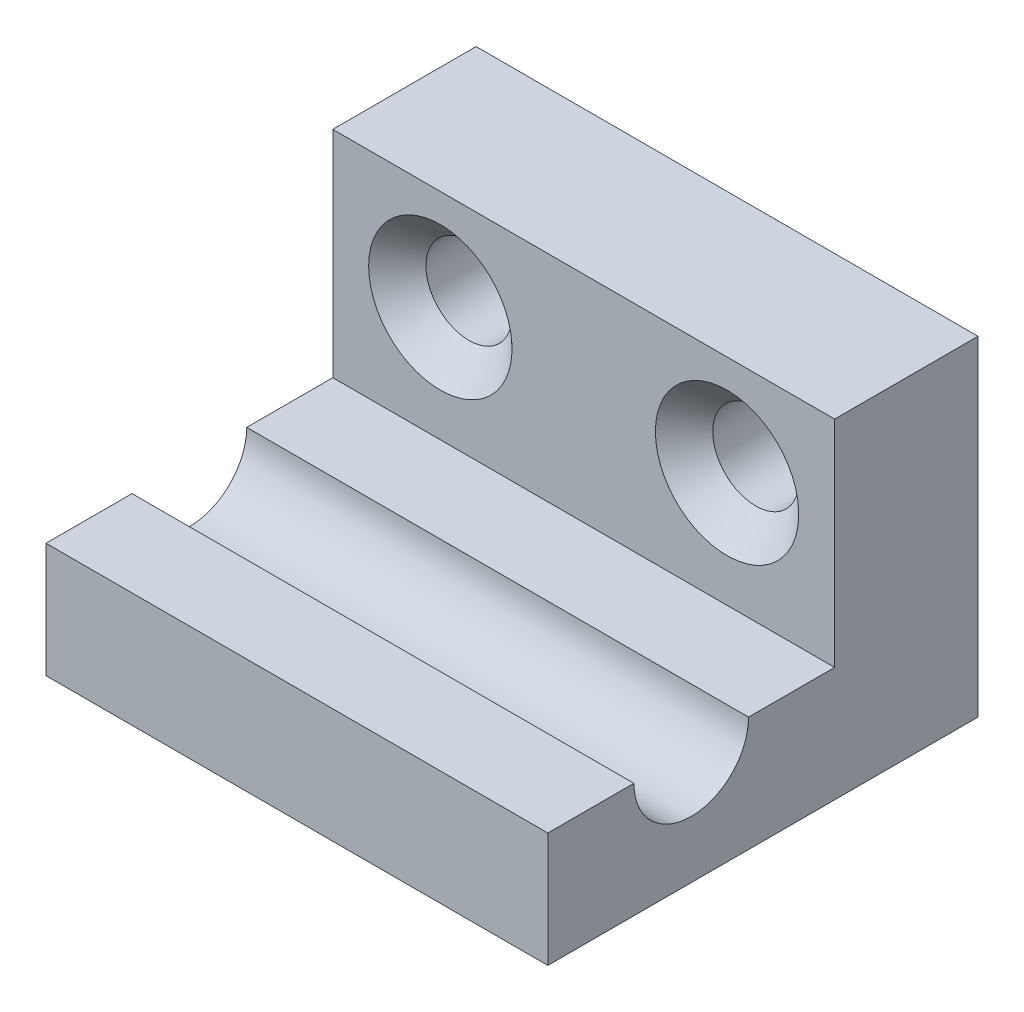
ISO-10303-21;
HEADER;
FILE_DESCRIPTION(('STEP AP214'),'2;1');
FILE_NAME('part.step','',(''),(''),'','','');
FILE_SCHEMA(('AUTOMOTIVE_DESIGN { 1 0 10303 214 1 1 1 1 }'));
ENDSEC;
DATA;
#1=APPLICATION_CONTEXT('core data for automotive mechanical design processes');
#2=APPLICATION_PROTOCOL_DEFINITION('international standard','automotive_design',2000,#1);
#3=PRODUCT_CONTEXT('',#1,'mechanical');
#4=PRODUCT('Part','Part','',(#3));
#5=PRODUCT_RELATED_PRODUCT_CATEGORY('part','',(#4));
#6=PRODUCT_DEFINITION_FORMATION('','',#4);
#7=PRODUCT_DEFINITION_CONTEXT('part definition',#1,'design');
#8=PRODUCT_DEFINITION('design','',#6,#7);
#9=PRODUCT_DEFINITION_SHAPE('','',#8);
#10=(LENGTH_UNIT() NAMED_UNIT(*) SI_UNIT(.MILLI.,.METRE.));
#11=(NAMED_UNIT(*) PLANE_ANGLE_UNIT() SI_UNIT($,.RADIAN.));
#12=(NAMED_UNIT(*) SI_UNIT($,.STERADIAN.) SOLID_ANGLE_UNIT());
#13=UNCERTAINTY_MEASURE_WITH_UNIT(LENGTH_MEASURE(1.E-05),#10,'distance_accuracy_value','');
#14=(GEOMETRIC_REPRESENTATION_CONTEXT(3) GLOBAL_UNCERTAINTY_ASSIGNED_CONTEXT((#13)) GLOBAL_UNIT_ASSIGNED_CONTEXT((#10,
#11,#12)) REPRESENTATION_CONTEXT('',''));
#15=CARTESIAN_POINT('',(0.,0.,0.));
#16=DIRECTION('',(0.,0.,1.));
#17=DIRECTION('',(1.,0.,0.));
#18=AXIS2_PLACEMENT_3D('',#15,#16,#17);
#19=CARTESIAN_POINT('',(35.,8.,10.));
#20=DIRECTION('',(0.,-1.,0.));
#21=DIRECTION('',(0.,0.,-1.));
#22=AXIS2_PLACEMENT_3D('',#19,#20,#21);
#23=PLANE('',#22);
#24=DIRECTION('',(0.,0.,1.));
#25=VECTOR('',#24,1.);
#26=CARTESIAN_POINT('',(0.,8.,10.));
#27=LINE('',#26,#25);
#28=CARTESIAN_POINT('',(0.,8.,10.));
#29=VERTEX_POINT('',#28);
#30=CARTESIAN_POINT('',(0.,8.,16.));
#31=VERTEX_POINT('',#30);
#32=EDGE_CURVE('E142',#29,#31,#27,.T.);
#33=ORIENTED_EDGE('',*,*,#32,.T.);
#34=DIRECTION('',(1.,0.,0.));
#35=VECTOR('',#34,1.);
#36=CARTESIAN_POINT('',(-5.,8.,16.));
#37=LINE('',#36,#35);
#38=CARTESIAN_POINT('',(35.,8.,16.));
#39=VERTEX_POINT('',#38);
#40=EDGE_CURVE('E48',#31,#39,#37,.T.);
#41=ORIENTED_EDGE('',*,*,#40,.T.);
#42=DIRECTION('',(0.,0.,1.));
#43=VECTOR('',#42,1.);
#44=CARTESIAN_POINT('',(35.,8.,10.));
#45=LINE('',#44,#43);
#46=CARTESIAN_POINT('',(35.,8.,10.));
#47=VERTEX_POINT('',#46);
#48=EDGE_CURVE('E108',#47,#39,#45,.T.);
#49=ORIENTED_EDGE('',*,*,#48,.F.);
#50=DIRECTION('',(-1.,0.,0.));
#51=VECTOR('',#50,1.);
#52=CARTESIAN_POINT('',(35.,8.,10.));
#53=LINE('',#52,#51);
#54=EDGE_CURVE('E117',#47,#29,#53,.T.);
#55=ORIENTED_EDGE('',*,*,#54,.T.);
#56=EDGE_LOOP('',(#33,#41,#49,#55));
#57=FACE_BOUND('',#56,.T.);
#58=ADVANCED_FACE('F33',(#57),#23,.F.);
#59=CARTESIAN_POINT('',(35.,0.,30.));
#60=DIRECTION('',(0.,1.,0.));
#61=DIRECTION('',(0.,0.,1.));
#62=AXIS2_PLACEMENT_3D('',#59,#60,#61);
#63=PLANE('',#62);
#64=DIRECTION('',(0.,0.,-1.));
#65=VECTOR('',#64,1.);
#66=CARTESIAN_POINT('',(0.,0.,30.));
#67=LINE('',#66,#65);
#68=CARTESIAN_POINT('',(0.,0.,30.));
#69=VERTEX_POINT('',#68);
#70=CARTESIAN_POINT('',(0.,0.,0.));
#71=VERTEX_POINT('',#70);
#72=EDGE_CURVE('E132',#69,#71,#67,.T.);
#73=ORIENTED_EDGE('',*,*,#72,.T.);
#74=DIRECTION('',(-1.,0.,0.));
#75=VECTOR('',#74,1.);
#76=CARTESIAN_POINT('',(35.,0.,0.));
#77=LINE('',#76,#75);
#78=CARTESIAN_POINT('',(35.,0.,0.));
#79=VERTEX_POINT('',#78);
#80=EDGE_CURVE('E152',#79,#71,#77,.T.);
#81=ORIENTED_EDGE('',*,*,#80,.F.);
#82=DIRECTION('',(0.,0.,-1.));
#83=VECTOR('',#82,1.);
#84=CARTESIAN_POINT('',(35.,0.,30.));
#85=LINE('',#84,#83);
#86=CARTESIAN_POINT('',(35.,0.,30.));
#87=VERTEX_POINT('',#86);
#88=EDGE_CURVE('E145',#87,#79,#85,.T.);
#89=ORIENTED_EDGE('',*,*,#88,.F.);
#90=DIRECTION('',(-1.,0.,0.));
#91=VECTOR('',#90,1.);
#92=CARTESIAN_POINT('',(35.,0.,30.));
#93=LINE('',#92,#91);
#94=EDGE_CURVE('E128',#87,#69,#93,.T.);
#95=ORIENTED_EDGE('',*,*,#94,.T.);
#96=EDGE_LOOP('',(#73,#81,#89,#95));
#97=FACE_BOUND('',#96,.T.);
#98=ADVANCED_FACE('F181',(#97),#63,.F.);
#99=CARTESIAN_POINT('',(35.,0.,0.));
#100=DIRECTION('',(0.,0.,1.));
#101=DIRECTION('',(1.,0.,0.));
#102=AXIS2_PLACEMENT_3D('',#99,#100,#101);
#103=PLANE('',#102);
#104=CARTESIAN_POINT('',(27.5,16.,0.));
#105=DIRECTION('',(0.,0.,1.));
#106=DIRECTION('',(1.,0.,0.));
#107=AXIS2_PLACEMENT_3D('',#104,#105,#106);
#108=CIRCLE('',#107,3.);
#109=CARTESIAN_POINT('',(30.5,16.,0.));
#110=VERTEX_POINT('',#109);
#111=EDGE_CURVE('E213',#110,#110,#108,.T.);
#112=ORIENTED_EDGE('',*,*,#111,.T.);
#113=EDGE_LOOP('',(#112));
#114=FACE_BOUND('',#113,.T.);
#115=CARTESIAN_POINT('',(7.5,16.,0.));
#116=DIRECTION('',(0.,0.,1.));
#117=DIRECTION('',(1.,0.,0.));
#118=AXIS2_PLACEMENT_3D('',#115,#116,#117);
#119=CIRCLE('',#118,3.);
#120=CARTESIAN_POINT('',(10.5,16.,0.));
#121=VERTEX_POINT('',#120);
#122=EDGE_CURVE('E136',#121,#121,#119,.T.);
#123=ORIENTED_EDGE('',*,*,#122,.T.);
#124=EDGE_LOOP('',(#123));
#125=FACE_BOUND('',#124,.T.);
#126=DIRECTION('',(0.,1.,0.));
#127=VECTOR('',#126,1.);
#128=CARTESIAN_POINT('',(0.,0.,0.));
#129=LINE('',#128,#127);
#130=CARTESIAN_POINT('',(0.,23.,0.));
#131=VERTEX_POINT('',#130);
#132=EDGE_CURVE('E135',#71,#131,#129,.T.);
#133=ORIENTED_EDGE('',*,*,#132,.T.);
#134=DIRECTION('',(-1.,0.,0.));
#135=VECTOR('',#134,1.);
#136=CARTESIAN_POINT('',(35.,23.,0.));
#137=LINE('',#136,#135);
#138=CARTESIAN_POINT('',(35.,23.,0.));
#139=VERTEX_POINT('',#138);
#140=EDGE_CURVE('E149',#139,#131,#137,.T.);
#141=ORIENTED_EDGE('',*,*,#140,.F.);
#142=DIRECTION('',(0.,1.,0.));
#143=VECTOR('',#142,1.);
#144=CARTESIAN_POINT('',(35.,0.,0.));
#145=LINE('',#144,#143);
#146=EDGE_CURVE('E92',#79,#139,#145,.T.);
#147=ORIENTED_EDGE('',*,*,#146,.F.);
#148=ORIENTED_EDGE('',*,*,#80,.T.);
#149=EDGE_LOOP('',(#133,#141,#147,#148));
#150=FACE_BOUND('',#149,.T.);
#151=ADVANCED_FACE('F187',(#114,#125,#150),#103,.F.);
#152=CARTESIAN_POINT('',(35.,23.,0.));
#153=DIRECTION('',(0.,-1.,0.));
#154=DIRECTION('',(0.,0.,-1.));
#155=AXIS2_PLACEMENT_3D('',#152,#153,#154);
#156=PLANE('',#155);
#157=DIRECTION('',(0.,0.,1.));
#158=VECTOR('',#157,1.);
#159=CARTESIAN_POINT('',(0.,23.,0.));
#160=LINE('',#159,#158);
#161=CARTESIAN_POINT('',(0.,23.,10.));
#162=VERTEX_POINT('',#161);
#163=EDGE_CURVE('E138',#131,#162,#160,.T.);
#164=ORIENTED_EDGE('',*,*,#163,.T.);
#165=DIRECTION('',(-1.,0.,0.));
#166=VECTOR('',#165,1.);
#167=CARTESIAN_POINT('',(35.,23.,10.));
#168=LINE('',#167,#166);
#169=CARTESIAN_POINT('',(35.,23.,10.));
#170=VERTEX_POINT('',#169);
#171=EDGE_CURVE('E124',#170,#162,#168,.T.);
#172=ORIENTED_EDGE('',*,*,#171,.F.);
#173=DIRECTION('',(0.,0.,1.));
#174=VECTOR('',#173,1.);
#175=CARTESIAN_POINT('',(35.,23.,0.));
#176=LINE('',#175,#174);
#177=EDGE_CURVE('E110',#139,#170,#176,.T.);
#178=ORIENTED_EDGE('',*,*,#177,.F.);
#179=ORIENTED_EDGE('',*,*,#140,.T.);
#180=EDGE_LOOP('',(#164,#172,#178,#179));
#181=FACE_BOUND('',#180,.T.);
#182=ADVANCED_FACE('F199',(#181),#156,.F.);
#183=CARTESIAN_POINT('',(35.,23.,10.));
#184=DIRECTION('',(0.,0.,-1.));
#185=DIRECTION('',(-1.,0.,0.));
#186=AXIS2_PLACEMENT_3D('',#183,#184,#185);
#187=PLANE('',#186);
#188=CARTESIAN_POINT('',(27.5,16.,10.));
#189=DIRECTION('',(0.,0.,-1.));
#190=DIRECTION('',(-1.,0.,0.));
#191=AXIS2_PLACEMENT_3D('',#188,#189,#190);
#192=CIRCLE('',#191,5.00000000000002);
#193=CARTESIAN_POINT('',(22.5,16.,10.));
#194=VERTEX_POINT('',#193);
#195=EDGE_CURVE('E160',#194,#194,#192,.T.);
#196=ORIENTED_EDGE('',*,*,#195,.T.);
#197=EDGE_LOOP('',(#196));
#198=FACE_BOUND('',#197,.T.);
#199=CARTESIAN_POINT('',(7.5,16.,10.));
#200=DIRECTION('',(0.,0.,-1.));
#201=DIRECTION('',(-1.,0.,0.));
#202=AXIS2_PLACEMENT_3D('',#199,#200,#201);
#203=CIRCLE('',#202,5.);
#204=CARTESIAN_POINT('',(2.5,16.,10.));
#205=VERTEX_POINT('',#204);
#206=EDGE_CURVE('E157',#205,#205,#203,.T.);
#207=ORIENTED_EDGE('',*,*,#206,.T.);
#208=EDGE_LOOP('',(#207));
#209=FACE_BOUND('',#208,.T.);
#210=DIRECTION('',(0.,-1.,0.));
#211=VECTOR('',#210,1.);
#212=CARTESIAN_POINT('',(0.,23.,10.));
#213=LINE('',#212,#211);
#214=EDGE_CURVE('E120',#162,#29,#213,.T.);
#215=ORIENTED_EDGE('',*,*,#214,.T.);
#216=ORIENTED_EDGE('',*,*,#54,.F.);
#217=DIRECTION('',(0.,-1.,0.));
#218=VECTOR('',#217,1.);
#219=CARTESIAN_POINT('',(35.,23.,10.));
#220=LINE('',#219,#218);
#221=EDGE_CURVE('E102',#170,#47,#220,.T.);
#222=ORIENTED_EDGE('',*,*,#221,.F.);
#223=ORIENTED_EDGE('',*,*,#171,.T.);
#224=EDGE_LOOP('',(#215,#216,#222,#223));
#225=FACE_BOUND('',#224,.T.);
#226=ADVANCED_FACE('F118',(#198,#209,#225),#187,.F.);
#227=CARTESIAN_POINT('',(35.,8.,24.));
#228=VERTEX_POINT('',#227);
#229=CARTESIAN_POINT('',(35.,8.,30.));
#230=VERTEX_POINT('',#229);
#231=EDGE_CURVE('E114',#228,#230,#45,.T.);
#232=ORIENTED_EDGE('',*,*,#231,.F.);
#233=DIRECTION('',(1.,0.,0.));
#234=VECTOR('',#233,1.);
#235=CARTESIAN_POINT('',(-5.,8.,24.));
#236=LINE('',#235,#234);
#237=CARTESIAN_POINT('',(0.,8.,24.));
#238=VERTEX_POINT('',#237);
#239=EDGE_CURVE('E206',#228,#238,#236,.F.);
#240=ORIENTED_EDGE('',*,*,#239,.T.);
#241=CARTESIAN_POINT('',(0.,8.,30.));
#242=VERTEX_POINT('',#241);
#243=EDGE_CURVE('E141',#238,#242,#27,.T.);
#244=ORIENTED_EDGE('',*,*,#243,.T.);
#245=DIRECTION('',(-1.,0.,0.));
#246=VECTOR('',#245,1.);
#247=CARTESIAN_POINT('',(35.,8.,30.));
#248=LINE('',#247,#246);
#249=EDGE_CURVE('E125',#230,#242,#248,.T.);
#250=ORIENTED_EDGE('',*,*,#249,.F.);
#251=EDGE_LOOP('',(#232,#240,#244,#250));
#252=FACE_BOUND('',#251,.T.);
#253=ADVANCED_FACE('F183',(#252),#23,.F.);
#254=CARTESIAN_POINT('',(35.,8.,30.));
#255=DIRECTION('',(0.,0.,-1.));
#256=DIRECTION('',(-1.,0.,0.));
#257=AXIS2_PLACEMENT_3D('',#254,#255,#256);
#258=PLANE('',#257);
#259=DIRECTION('',(0.,-1.,0.));
#260=VECTOR('',#259,1.);
#261=CARTESIAN_POINT('',(0.,8.,30.));
#262=LINE('',#261,#260);
#263=EDGE_CURVE('E83',#242,#69,#262,.T.);
#264=ORIENTED_EDGE('',*,*,#263,.T.);
#265=ORIENTED_EDGE('',*,*,#94,.F.);
#266=DIRECTION('',(0.,-1.,0.));
#267=VECTOR('',#266,1.);
#268=CARTESIAN_POINT('',(35.,8.,30.));
#269=LINE('',#268,#267);
#270=EDGE_CURVE('E56',#230,#87,#269,.T.);
#271=ORIENTED_EDGE('',*,*,#270,.F.);
#272=ORIENTED_EDGE('',*,*,#249,.T.);
#273=EDGE_LOOP('',(#264,#265,#271,#272));
#274=FACE_BOUND('',#273,.T.);
#275=ADVANCED_FACE('F193',(#274),#258,.F.);
#276=CARTESIAN_POINT('',(35.,0.,0.));
#277=DIRECTION('',(1.,0.,0.));
#278=DIRECTION('',(0.,0.,-1.));
#279=AXIS2_PLACEMENT_3D('',#276,#277,#278);
#280=PLANE('',#279);
#281=CARTESIAN_POINT('',(35.,8.,20.));
#282=DIRECTION('',(1.,0.,0.));
#283=DIRECTION('',(0.,0.,-1.));
#284=AXIS2_PLACEMENT_3D('',#281,#282,#283);
#285=CIRCLE('',#284,4.);
#286=EDGE_CURVE('E208',#228,#39,#285,.T.);
#287=ORIENTED_EDGE('',*,*,#286,.F.);
#288=ORIENTED_EDGE('',*,*,#231,.T.);
#289=ORIENTED_EDGE('',*,*,#270,.T.);
#290=ORIENTED_EDGE('',*,*,#88,.T.);
#291=ORIENTED_EDGE('',*,*,#146,.T.);
#292=ORIENTED_EDGE('',*,*,#177,.T.);
#293=ORIENTED_EDGE('',*,*,#221,.T.);
#294=ORIENTED_EDGE('',*,*,#48,.T.);
#295=EDGE_LOOP('',(#287,#288,#289,#290,#291,#292,#293,#294));
#296=FACE_BOUND('',#295,.T.);
#297=ADVANCED_FACE('F105',(#296),#280,.T.);
#298=CARTESIAN_POINT('',(0.,0.,0.));
#299=DIRECTION('',(1.,0.,0.));
#300=DIRECTION('',(0.,0.,-1.));
#301=AXIS2_PLACEMENT_3D('',#298,#299,#300);
#302=PLANE('',#301);
#303=ORIENTED_EDGE('',*,*,#243,.F.);
#304=CARTESIAN_POINT('',(0.,8.,20.));
#305=DIRECTION('',(1.,0.,0.));
#306=DIRECTION('',(0.,0.,-1.));
#307=AXIS2_PLACEMENT_3D('',#304,#305,#306);
#308=CIRCLE('',#307,4.);
#309=EDGE_CURVE('E11',#238,#31,#308,.T.);
#310=ORIENTED_EDGE('',*,*,#309,.T.);
#311=ORIENTED_EDGE('',*,*,#32,.F.);
#312=ORIENTED_EDGE('',*,*,#214,.F.);
#313=ORIENTED_EDGE('',*,*,#163,.F.);
#314=ORIENTED_EDGE('',*,*,#132,.F.);
#315=ORIENTED_EDGE('',*,*,#72,.F.);
#316=ORIENTED_EDGE('',*,*,#263,.F.);
#317=EDGE_LOOP('',(#303,#310,#311,#312,#313,#314,#315,#316));
#318=FACE_BOUND('',#317,.T.);
#319=ADVANCED_FACE('F224',(#318),#302,.F.);
#320=CARTESIAN_POINT('',(7.5,16.,-30.));
#321=DIRECTION('',(0.,0.,1.));
#322=DIRECTION('',(1.,0.,0.));
#323=AXIS2_PLACEMENT_3D('',#320,#321,#322);
#324=CYLINDRICAL_SURFACE('',#323,3.);
#325=CARTESIAN_POINT('',(7.5,16.,8.00000000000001));
#326=DIRECTION('',(0.,0.,-1.));
#327=DIRECTION('',(-1.,0.,0.));
#328=AXIS2_PLACEMENT_3D('',#325,#326,#327);
#329=CIRCLE('',#328,3.);
#330=CARTESIAN_POINT('',(4.5,16.,8.00000000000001));
#331=VERTEX_POINT('',#330);
#332=EDGE_CURVE('E41',#331,#331,#329,.F.);
#333=ORIENTED_EDGE('',*,*,#332,.T.);
#334=EDGE_LOOP('',(#333));
#335=FACE_BOUND('',#334,.T.);
#336=ORIENTED_EDGE('',*,*,#122,.F.);
#337=EDGE_LOOP('',(#336));
#338=FACE_BOUND('',#337,.T.);
#339=ADVANCED_FACE('F165',(#335,#338),#324,.F.);
#340=CARTESIAN_POINT('',(27.5,16.,-30.));
#341=DIRECTION('',(0.,0.,1.));
#342=DIRECTION('',(1.,0.,0.));
#343=AXIS2_PLACEMENT_3D('',#340,#341,#342);
#344=CYLINDRICAL_SURFACE('',#343,3.);
#345=CARTESIAN_POINT('',(27.5,16.,7.99999999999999));
#346=DIRECTION('',(0.,0.,-1.));
#347=DIRECTION('',(-1.,0.,0.));
#348=AXIS2_PLACEMENT_3D('',#345,#346,#347);
#349=CIRCLE('',#348,3.);
#350=CARTESIAN_POINT('',(24.5,16.,7.99999999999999));
#351=VERTEX_POINT('',#350);
#352=EDGE_CURVE('E154',#351,#351,#349,.F.);
#353=ORIENTED_EDGE('',*,*,#352,.T.);
#354=EDGE_LOOP('',(#353));
#355=FACE_BOUND('',#354,.T.);
#356=ORIENTED_EDGE('',*,*,#111,.F.);
#357=EDGE_LOOP('',(#356));
#358=FACE_BOUND('',#357,.T.);
#359=ADVANCED_FACE('F177',(#355,#358),#344,.F.);
#360=CARTESIAN_POINT('',(27.5,16.,7.99999999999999));
#361=DIRECTION('',(0.,0.,1.));
#362=DIRECTION('',(1.,0.,0.));
#363=AXIS2_PLACEMENT_3D('',#360,#361,#362);
#364=CONICAL_SURFACE('',#363,3.,0.785398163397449);
#365=ORIENTED_EDGE('',*,*,#195,.F.);
#366=EDGE_LOOP('',(#365));
#367=FACE_BOUND('',#366,.T.);
#368=ORIENTED_EDGE('',*,*,#352,.F.);
#369=EDGE_LOOP('',(#368));
#370=FACE_BOUND('',#369,.T.);
#371=ADVANCED_FACE('F170',(#367,#370),#364,.F.);
#372=CARTESIAN_POINT('',(7.5,16.,8.00000000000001));
#373=DIRECTION('',(0.,0.,1.));
#374=DIRECTION('',(1.,0.,0.));
#375=AXIS2_PLACEMENT_3D('',#372,#373,#374);
#376=CONICAL_SURFACE('',#375,3.,0.785398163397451);
#377=ORIENTED_EDGE('',*,*,#206,.F.);
#378=EDGE_LOOP('',(#377));
#379=FACE_BOUND('',#378,.T.);
#380=ORIENTED_EDGE('',*,*,#332,.F.);
#381=EDGE_LOOP('',(#380));
#382=FACE_BOUND('',#381,.T.);
#383=ADVANCED_FACE('F35',(#379,#382),#376,.F.);
#384=CARTESIAN_POINT('',(-5.,8.,20.));
#385=DIRECTION('',(1.,0.,0.));
#386=DIRECTION('',(0.,0.,-1.));
#387=AXIS2_PLACEMENT_3D('',#384,#385,#386);
#388=CYLINDRICAL_SURFACE('',#387,4.);
#389=ORIENTED_EDGE('',*,*,#309,.F.);
#390=ORIENTED_EDGE('',*,*,#239,.F.);
#391=ORIENTED_EDGE('',*,*,#286,.T.);
#392=ORIENTED_EDGE('',*,*,#40,.F.);
#393=EDGE_LOOP('',(#389,#390,#391,#392));
#394=FACE_BOUND('',#393,.T.);
#395=ADVANCED_FACE('F169',(#394),#388,.F.);
#396=CLOSED_SHELL('',(#58,#98,#151,#182,#226,#253,#275,#297,#319,#339,#359,#371,#383,#395));
#397=MANIFOLD_SOLID_BREP('B2',#396);
#398=ADVANCED_BREP_SHAPE_REPRESENTATION('',(#18,#397),#14);
#399=SHAPE_DEFINITION_REPRESENTATION(#9,#398);
ENDSEC;
END-ISO-10303-21;
